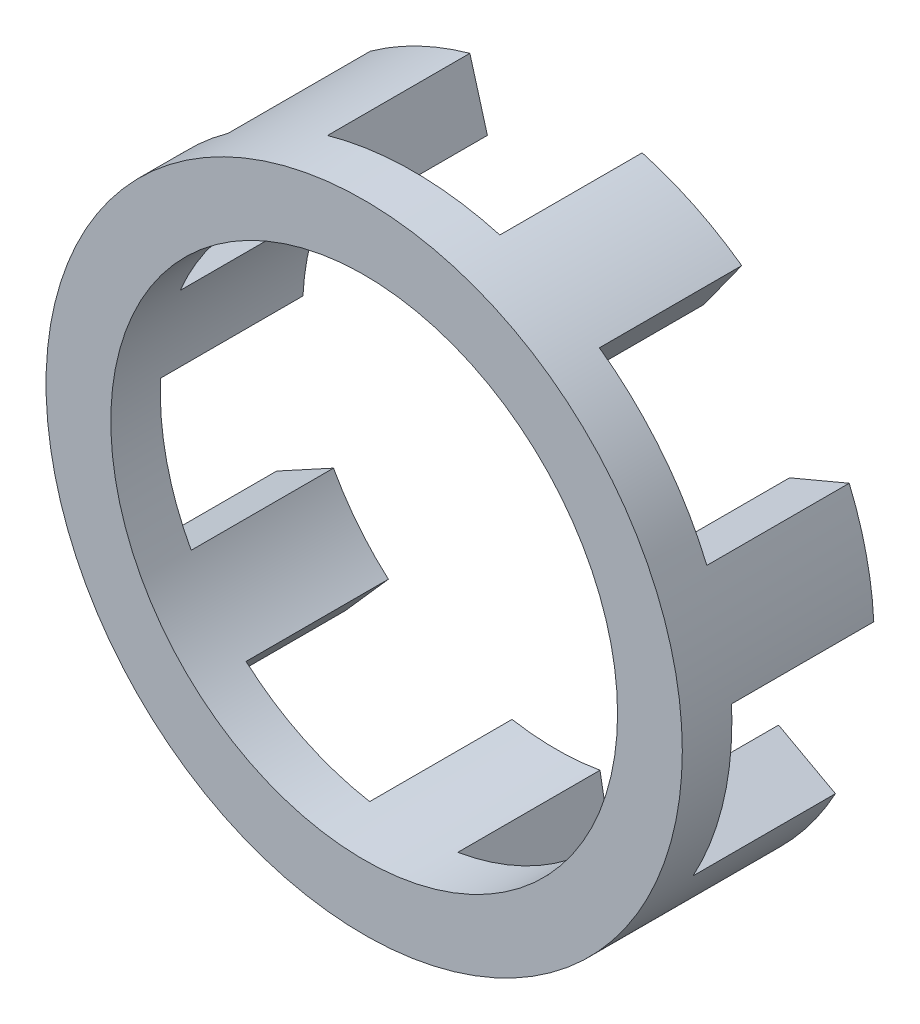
from build123d import *
from build123d.topology import SkipClean

# Parameters (mm, degrees)
SKETCH1_R           = 8.16075461
SKETCH1_R_2         = 6.499841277
BOSS_EXTRUDE1_DEPTH = 1.27
BOSS_EXTRUDE2_DEPTH = 3.65125
CIRPATTERN1_COUNT   = 7


with BuildPart() as part:
    # Sketch1 → Boss-Extrude1 (new body)
    with BuildSketch(Plane.XY):
        with Locations((-0.03642764, -0.05941273)):
            Circle(SKETCH1_R)
        with Locations((-0.03642764, -0.05941273)):
            Circle(SKETCH1_R_2, mode=Mode.SUBTRACT)
    extrude(amount=-BOSS_EXTRUDE1_DEPTH)

    # Sketch2 → Boss-Extrude2 (add)
    with BuildSketch(Plane(origin=(0, 0, -1.27), x_dir=(-1, 0, 0), z_dir=(0, 0, -1))):
        with BuildLine():
            Line((1.165113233, -6.460506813), (1.453527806, -8.096187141))
            ThreePointArc((1.453527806, -8.096187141), (0.03642764, -8.22016734), (-1.380672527, -8.096187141))
            Line((-1.380672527, -8.096187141), (-1.092257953, -6.460506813))
            ThreePointArc((-1.092257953, -6.460506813), (0.03642764, -6.559254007), (1.165113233, -6.460506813))
        make_face()
    boss_extrude2 = extrude(amount=BOSS_EXTRUDE2_DEPTH)

    # CirPattern1: Boss-Extrude2 ×7 about axis
    with SkipClean():  # the faces are left unmerged after this step: merging them gives an invalid solid
        cirpattern1_axis = Axis((-0.03642764, -0.05941273, 0), (0, 0, 1))
        for i in range(1, CIRPATTERN1_COUNT):
            add(boss_extrude2.rotate(cirpattern1_axis, i * 360 / CIRPATTERN1_COUNT))


solid = part.part
